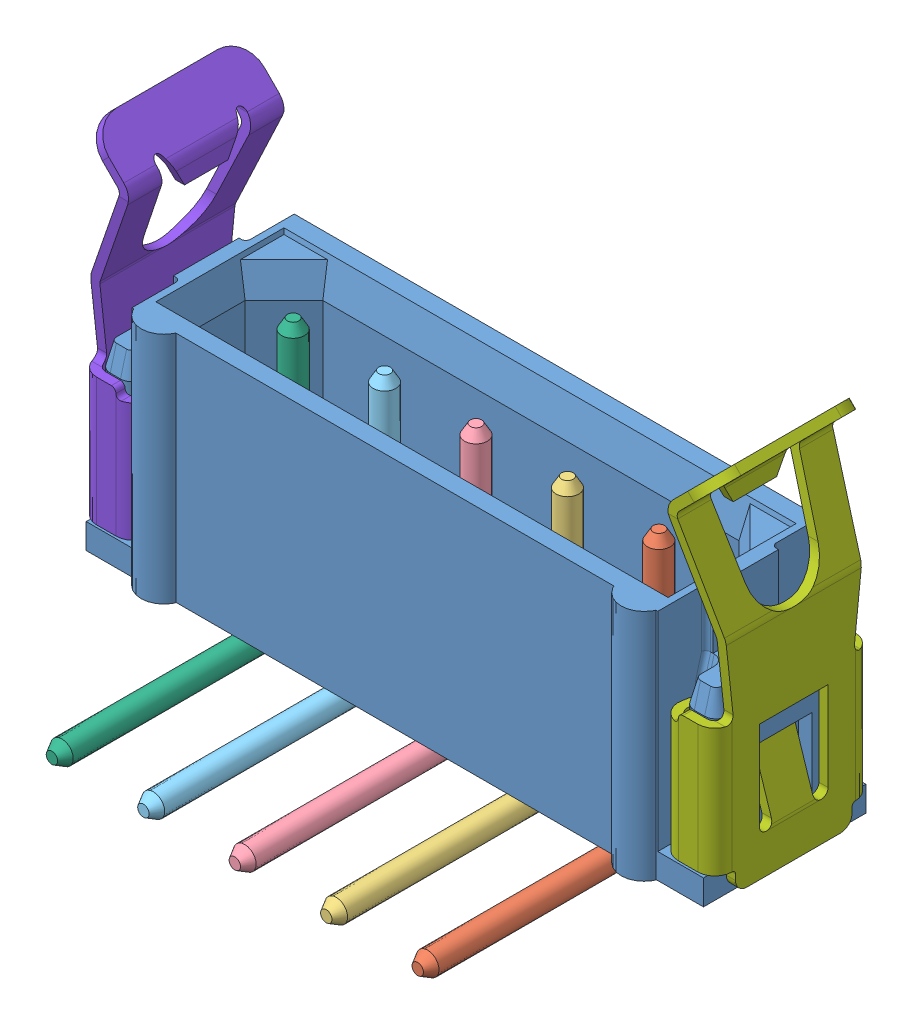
SolidWorks assembly m80-8420542_asm.sldasm, configuration Default (file format 6000). Lengths in mm.
Overall size (13.9 9.1 7.05).
9 component instances, 8 part files, 0 mates.
Components (placement in the parent):
- M80-8780522-1: M80-8780522.sldasm [Default] at origin size (13.5 6.15 7.05)
  - M80-1000598-1: M80-1000598.sldprt [Default] at origin size (13.5 5.4 3.85)
  - M80-878-PIN_6-1: M80-878-PIN_6.sldprt [Default] at origin size (0.8 5.95 5.68)
  - M80-878-PIN_1_2-1: M80-878-PIN_1_2.sldprt [Default] at origin size (0.8 5.95 5.68)
  - M80-878-PIN_2_1-1: M80-878-PIN_2_1.sldprt [Default] at origin size (0.8 5.95 5.68)
  - M80-878-PIN_3_1-1: M80-878-PIN_3_1.sldprt [Default] at origin size (0.8 5.95 5.68)
  - M80-878-PIN_4_1-1: M80-878-PIN_4_1.sldprt [Default] at origin size (0.8 5.95 5.68)
- M80-001XXXX_5-1: M80-001XXXX_5.sldprt [Default] at origin size (1.2 7.95 3.45)
- M80-001XXXX_1_4-1: M80-001XXXX_1_4.sldprt [Default] at origin size (1.2 7.95 3.45)
